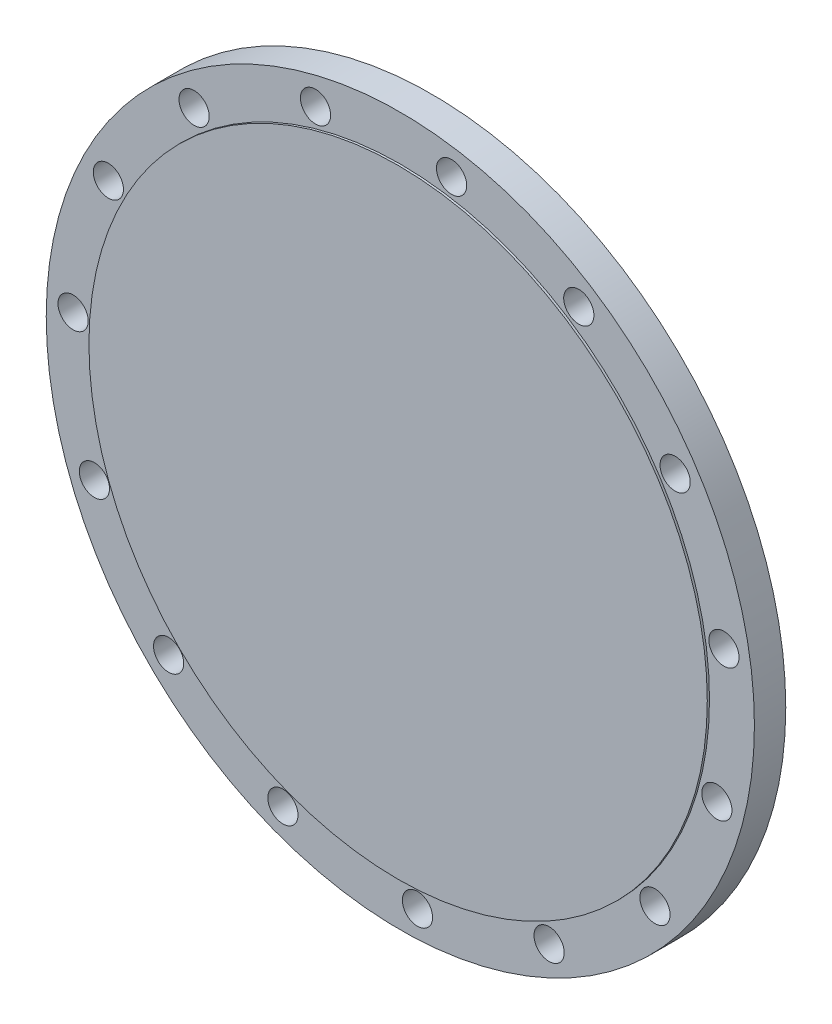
from build123d import *

# Parameters (mm, degrees)
SKETCH1_R          = 335.000000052
EXTRUDE1_DEPTH     = 31.75
SKETCH2_R          = 14.2875
CUT_EXTRUDE1_DEPTH = 475.824243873
CIRPATTERN1_COUNT  = 15
SKETCH12_OUTSIDE_W = 861.61
SKETCH12_OUTSIDE_H = 861.61
SKETCH12_OUTSIDE_R = 292.5
CUT_EXTRUDE2_DEPTH = 2.0955


with BuildPart() as part:
    # Sketch1 → Extrude1 (new body)
    with BuildSketch(Plane.XY):
        Circle(SKETCH1_R)
    extrude(amount=EXTRUDE1_DEPTH)

    # Sketch2 → Cut-Extrude1 (cut, through all)
    with BuildSketch(Plane.XY.offset(31.75)):
        with Locations((48.494684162, 306.183385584)):
            Circle(SKETCH2_R)
    cut_extrude1 = extrude(amount=-CUT_EXTRUDE1_DEPTH, mode=Mode.SUBTRACT)

    # CirPattern1: Cut-Extrude1 ×15 about axis
    cirpattern1_axis = Axis((0, 0, 0), (0, 0, 1))
    for i in range(1, CIRPATTERN1_COUNT):
        add(cut_extrude1.rotate(cirpattern1_axis, i * 360 / CIRPATTERN1_COUNT), mode=Mode.SUBTRACT)

    # Sketch12 outside → Cut-Extrude2 (cut)
    with BuildSketch(Plane.XY.offset(31.75)):
        Rectangle(SKETCH12_OUTSIDE_W, SKETCH12_OUTSIDE_H)
        Circle(SKETCH12_OUTSIDE_R, mode=Mode.SUBTRACT)
    extrude(amount=-CUT_EXTRUDE2_DEPTH, mode=Mode.SUBTRACT)


solid = part.part
